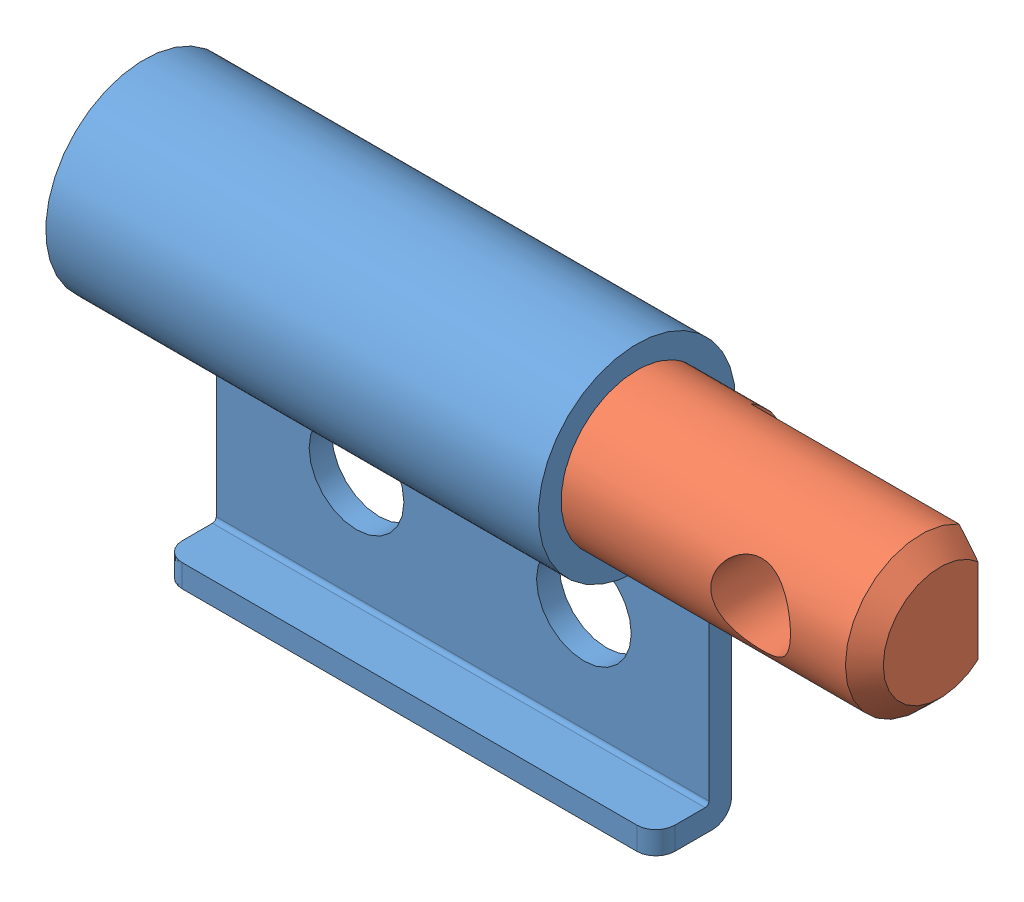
SolidWorks assembly ST025A0.SLDASM, configuration Default (file format 7000). Lengths in mm.
Overall size (21.03 12.1 5.2).
2 component instances, 2 part files, 3 mates.
Components (placement in the parent):
- ST025A BRACKET-1: ST025A BRACKET.SLDPRT [Default] at (17.922 0 0) x (-1 0 0) z (0 0 -1) size (13.06 12.1 5.2)
- ST025A1 Shaft-1: ST025A1 Shaft.SLDPRT [ST025] at (4.922 0 0) x (1 0 0) z (0 0 -1) size (21 4 4)
Mates (geometry in assembly coordinates):
- Coincident1: coincident: plane of ST025A BRACKET-1 through (4.922 0 0) normal (-1 0 0); plane of ST025A1 Shaft-1 through (4.922 0 0) normal (-1 0 0)
- Concentric1: concentric: cylinder of ST025A BRACKET-1 through (4.922 0 0) axis (1 0 0) radius 2; cylinder of ST025A1 Shaft-1 through (4.922 0 0) axis (-1 0 0) radius 2
- Parallel1: parallel aligned: plane of ST025A BRACKET-1 through (4.922 -9 -2.5) normal (0 0 -1); plane of ST025A1 Shaft-1 through (19.922 -1.7321 -1) normal (0 0 -1)
